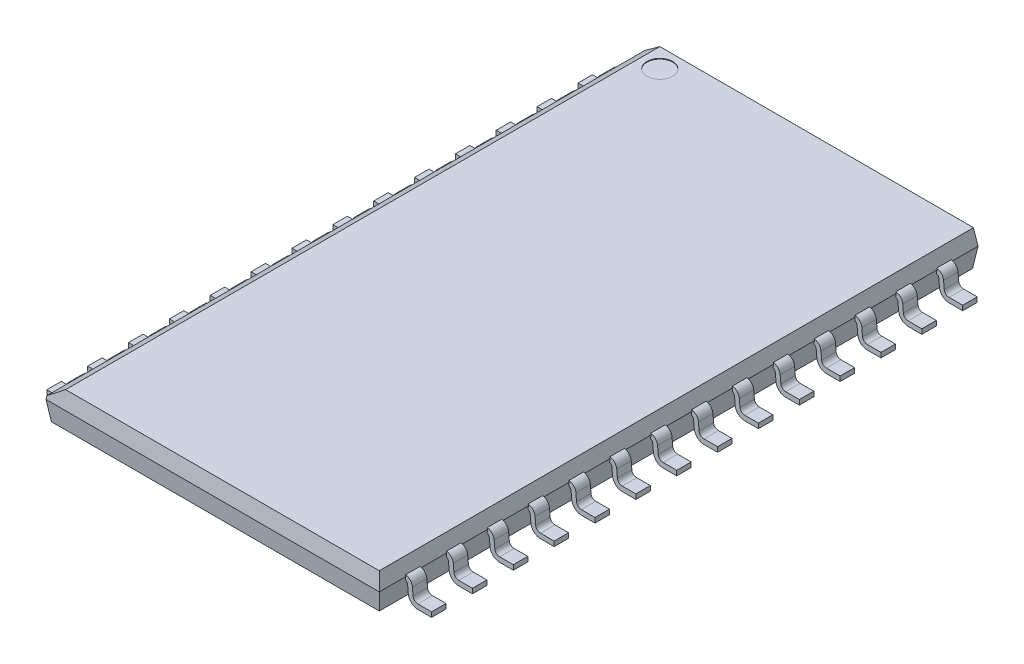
from build123d import *

# Parameters (mm, degrees)
EXTRUDE_1_DEPTH              = 0.225
SKETCH_8723_W                = 10.36
SKETCH_8723_H                = 18.61
EXTRUDE_8781_DEPTH           = 0.5
EXTRUDE_8781_TAPER           = 8
EXTRUDE_8781_OTHER_WAY_DEPTH = 0.6
EXTRUDE_8781_OTHER_WAY_TAPER = 8
PATTERN_LINEAR_8860_COUNT    = 14
PATTERN_LINEAR_8860_PITCH    = 1.27
CHAMFER_1_SIZE               = 0.4
CHAMFER_1_SIZE2              = 0.469982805
SKETCH_3_R                   = 0.4
CUT_EXTRUDE_3_DEPTH          = 0.02


with BuildPart() as part:
    # Sketch 1 → Extrude 1 (new, symmetric)
    with BuildSketch(Plane.XY.offset(-8.255)):
        with BuildLine():
            Line((-5.98, 0), (-5.554899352, 0))
            ThreePointArc((-5.554899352, 0), (-5.35222229, 0.078816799), (-5.256040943, 0.273853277))
            Line((-5.256040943, 0.273853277), (-5.235493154, 0.508715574))
            ThreePointArc((-5.235493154, 0.508715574), (-5.203432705, 0.573727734), (-5.135873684, 0.6))
            Line((-5.135873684, 0.6), (5.135873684, 0.6))
            ThreePointArc((5.135873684, 0.6), (5.203432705, 0.573727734), (5.235493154, 0.508715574))
            Line((5.235493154, 0.508715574), (5.256040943, 0.273853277))
            ThreePointArc((5.256040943, 0.273853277), (5.35222229, 0.078816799), (5.554899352, 0))
            Line((5.554899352, 0), (5.98, 0))
            Line((5.98, 0), (5.98, 0.15))
            Line((5.98, 0.15), (5.554899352, 0.15))
            ThreePointArc((5.554899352, 0.15), (5.453560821, 0.189408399), (5.405470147, 0.286926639))
            Line((5.405470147, 0.286926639), (5.384922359, 0.521788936))
            ThreePointArc((5.384922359, 0.521788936), (5.304771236, 0.684319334), (5.135873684, 0.75))
            Line((5.135873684, 0.75), (-5.135873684, 0.75))
            ThreePointArc((-5.135873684, 0.75), (-5.304771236, 0.684319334), (-5.384922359, 0.521788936))
            Line((-5.384922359, 0.521788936), (-5.405470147, 0.286926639))
            ThreePointArc((-5.405470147, 0.286926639), (-5.453560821, 0.189408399), (-5.554899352, 0.15))
            Line((-5.554899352, 0.15), (-5.98, 0.15))
            Line((-5.98, 0.15), (-5.98, 0))
        make_face()
    extrude_1 = extrude(amount=EXTRUDE_1_DEPTH, both=True)

    # Sketch 8723 → Extrude 8781 (add)
    with BuildSketch(Plane(origin=(0, 0.7, 0), x_dir=(1, 0, 0), z_dir=(0, 1, 0))):
        Rectangle(SKETCH_8723_W, SKETCH_8723_H)
    extrude(amount=EXTRUDE_8781_DEPTH, taper=EXTRUDE_8781_TAPER)

    # Sketch 8723 → Extrude 8781 other way (add)
    with BuildSketch(Plane(origin=(0, 0.7, 0), x_dir=(1, 0, 0), z_dir=(0, 1, 0))):
        Rectangle(SKETCH_8723_W, SKETCH_8723_H)
    extrude(amount=-EXTRUDE_8781_OTHER_WAY_DEPTH, taper=EXTRUDE_8781_OTHER_WAY_TAPER)

    # Pattern Linear 8860: Extrude 1 ×14
    with Locations(*[(0, 0, i * PATTERN_LINEAR_8860_PITCH) for i in range(1, PATTERN_LINEAR_8860_COUNT)]):
        add(extrude_1)

    # Chamfer 1
    chamfer_1_edges = [part.edges().sort_by_distance(p)[0] for p in [
        (-5.109729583, 1.2, 0),
    ]]
    chamfer_1_side = [part.faces().sort_by_distance(p)[0] for p in [
        (-5.14385673, 0.957172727, 0),
    ]]
    chamfer(chamfer_1_edges, length=CHAMFER_1_SIZE, length2=CHAMFER_1_SIZE2, reference=chamfer_1_side[0])

    # Sketch 3 → Cut-Extrude 3 (cut)
    with BuildSketch(Plane(origin=(0, 1.2, 0), x_dir=(1, 0, 0), z_dir=(0, 1, 0))):
        with Locations(Location((-4.039746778, 8.634729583, 0), (0, 0, 270))):
            Circle(SKETCH_3_R)
    extrude(amount=-CUT_EXTRUDE_3_DEPTH, mode=Mode.SUBTRACT)


solid = part.part
